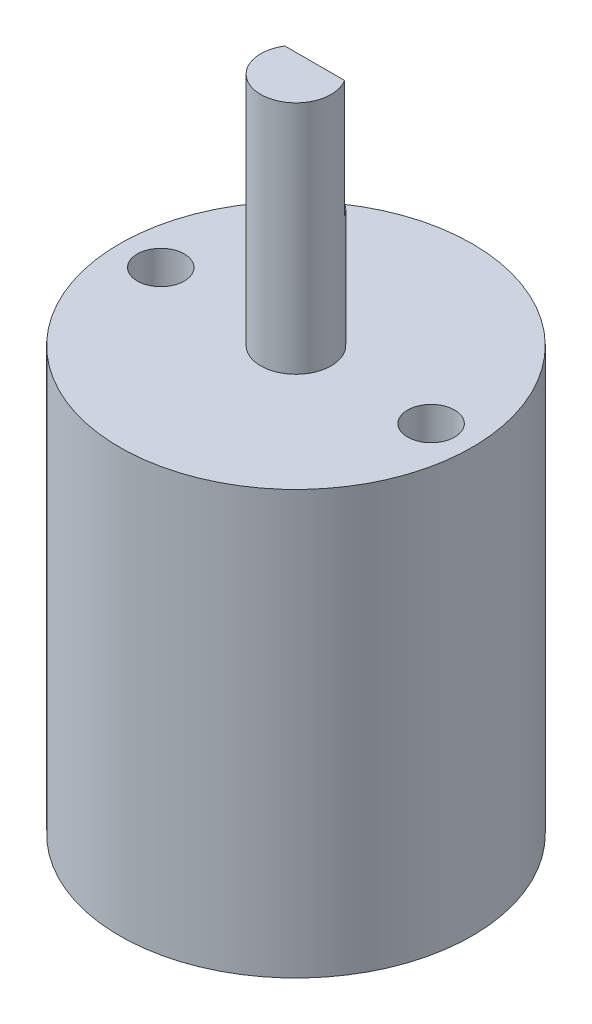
from build123d import *

# Parameters (mm, degrees)
SKETCH_2_R          = 1
CUT_EXTRUDE_1_DEPTH = 5
SKETCH_3_W          = 5.028706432
SKETCH_3_H          = 4.384892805
CUT_EXTRUDE_2_DEPTH = 5


with BuildPart() as part:
    # Sketch 1 → Revolve 1 (revolve)
    with BuildSketch(Plane.XY, mode=Mode.PRIVATE) as revolve_1_sk:
        Polygon((0, 0), (0, 28), (1.5, 28), (1.5, 18), (7.5, 18), (7.5, 0), align=None)
    revolve(revolve_1_sk.sketch.rotate(Axis((0, 0, 0), (0, 1, 0)), 90), axis=Axis((0, 0, 0), (0, 1, 0)))

    # Sketch 2 → Cut-Extrude 1 (cut)
    with BuildSketch(Plane(origin=(0, 18, 0), x_dir=(1, 0, 0), z_dir=(0, 1, 0))):
        with Locations(Location((-5.75, 0, 0), (0, 0, 270))):
            Circle(SKETCH_2_R)
        with Locations(Location((5.75, 0, 0), (0, 0, 90))):
            Circle(SKETCH_2_R)
    extrude(amount=-CUT_EXTRUDE_1_DEPTH, mode=Mode.SUBTRACT)

    # Sketch 3 → Cut-Extrude 2 (cut)
    with BuildSketch(Plane(origin=(0, 28, 0), x_dir=(1, 0, 0), z_dir=(0, 1, 0))):
        with Locations((0, 2.992446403)):
            Rectangle(SKETCH_3_W, SKETCH_3_H)
    extrude(amount=-CUT_EXTRUDE_2_DEPTH, mode=Mode.SUBTRACT)


solid = part.part
